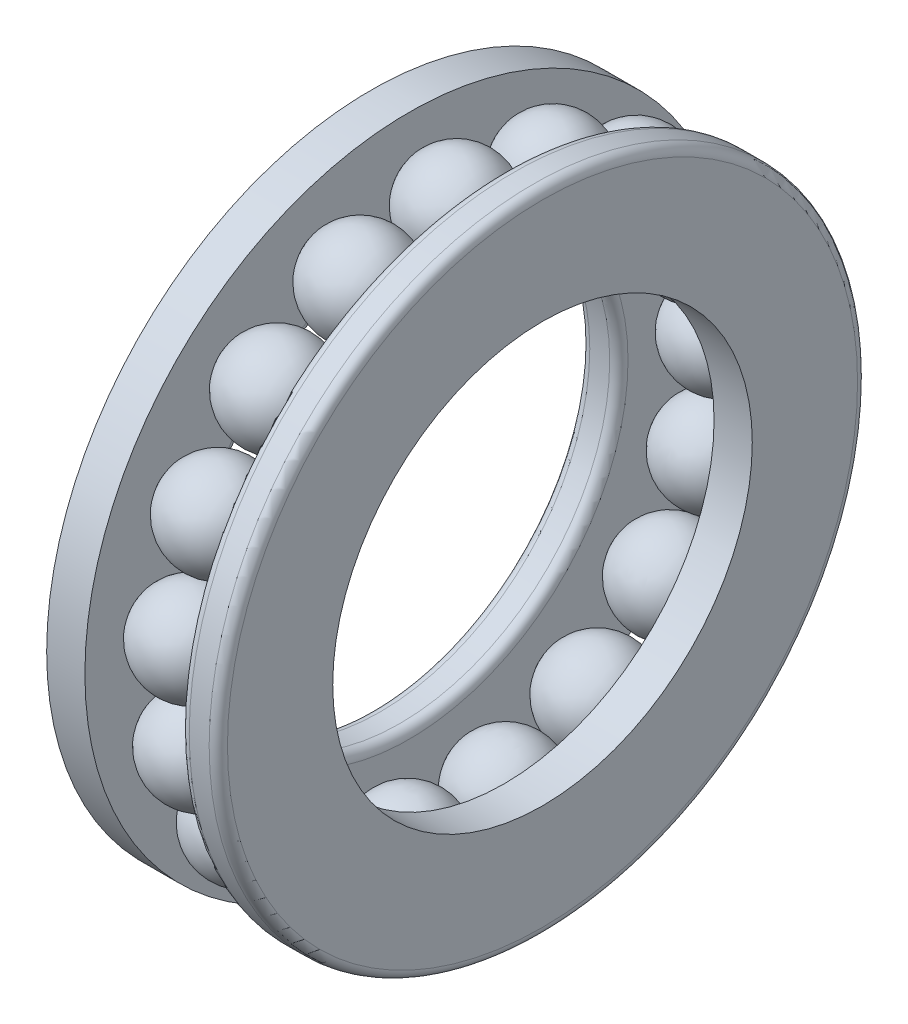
from build123d import *

# Parameters (mm, degrees)
INNRACSKE_W         = 6.3627
INNRACSKE_H         = 19.05
FILLET_2_R          = 1.524
BALLSDETAILED_COUNT = 17
BALLSDETAILED_ANGLE = 338.823529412


with BuildPart() as part:
    # InnRacSke → Race (revolve)
    with BuildSketch(Plane.XY, mode=Mode.PRIVATE) as race_sk:
        with Locations((-11.10615, 44.45)):
            Rectangle(INNRACSKE_W, INNRACSKE_H)
    race = revolve(race_sk.sketch.rotate(Axis((-34.925, 0, 0), (1, 0, 0)), 270), axis=Axis((-34.925, 0, 0), (1, 0, 0)))

    # BalDetSke → BallDetailed (revolve)
    with BuildSketch(Plane.XY):
        with BuildLine():
            Line((-7.9375, 44.45), (7.9375, 44.45))
            ThreePointArc((7.9375, 44.45), (0, 36.5125), (-7.9375, 44.45))
        make_face()
    balldetailed = revolve(axis=Axis((-14.57325, 44.45, 0), (1, 0, 0)))

    # Mirror1: Race across plane
    add(race.mirror(Plane(origin=(0, 0, 0), x_dir=(0, 0, 1), z_dir=(1, 0, 0))))

    # Fillet 2
    fillet_2_edges = [part.edges().sort_by_distance(p)[0] for p in [
        (7.9248, 0, 53.975),
        (14.2875, 0, 53.975),
        (-7.9248, 0, 34.925),
        (-14.2875, 0, 34.925),
    ]]
    fillet(fillet_2_edges, radius=FILLET_2_R)

    # BallsDetailed: BallDetailed ×17 about axis
    ballsdetailed_axis = Axis((-50, 0, 0), (1, 0, 0))
    for i in range(1, BALLSDETAILED_COUNT):
        add(balldetailed.rotate(ballsdetailed_axis, i * BALLSDETAILED_ANGLE / (BALLSDETAILED_COUNT - 1)))


solid = part.part
